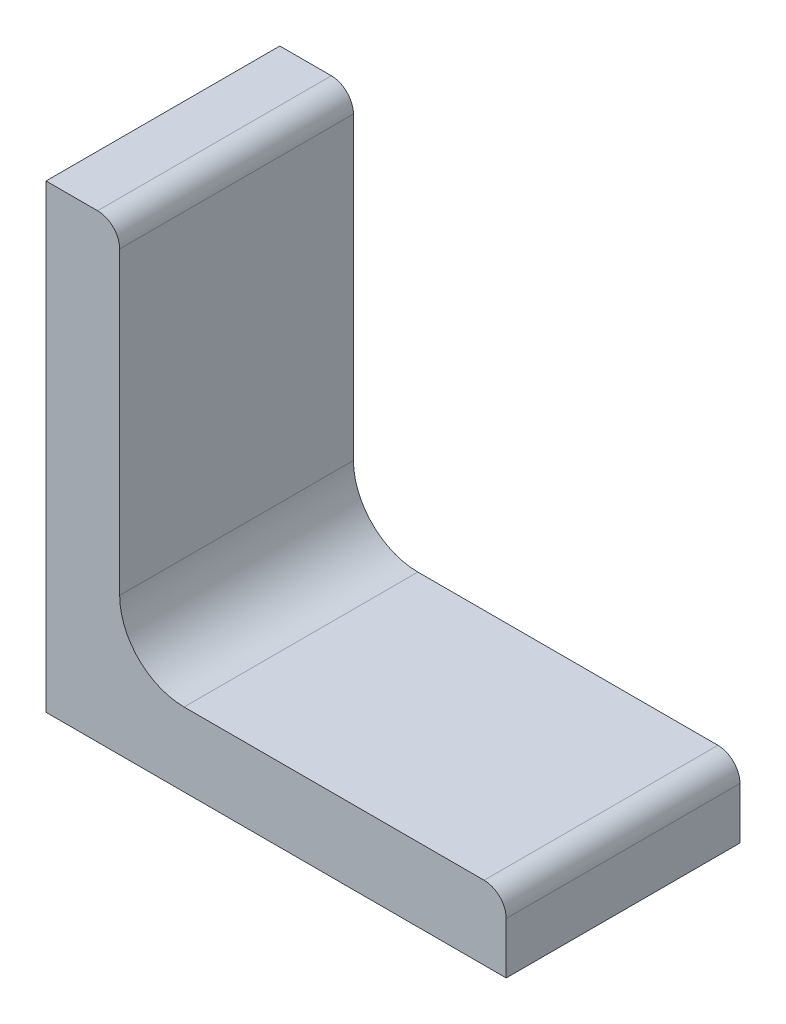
ISO-10303-21;
HEADER;
FILE_DESCRIPTION(('STEP AP214'),'2;1');
FILE_NAME('part.step','',(''),(''),'','','');
FILE_SCHEMA(('AUTOMOTIVE_DESIGN { 1 0 10303 214 1 1 1 1 }'));
ENDSEC;
DATA;
#1=APPLICATION_CONTEXT('core data for automotive mechanical design processes');
#2=APPLICATION_PROTOCOL_DEFINITION('international standard','automotive_design',2000,#1);
#3=PRODUCT_CONTEXT('',#1,'mechanical');
#4=PRODUCT('Part','Part','',(#3));
#5=PRODUCT_RELATED_PRODUCT_CATEGORY('part','',(#4));
#6=PRODUCT_DEFINITION_FORMATION('','',#4);
#7=PRODUCT_DEFINITION_CONTEXT('part definition',#1,'design');
#8=PRODUCT_DEFINITION('design','',#6,#7);
#9=PRODUCT_DEFINITION_SHAPE('','',#8);
#10=(LENGTH_UNIT() NAMED_UNIT(*) SI_UNIT(.MILLI.,.METRE.));
#11=(NAMED_UNIT(*) PLANE_ANGLE_UNIT() SI_UNIT($,.RADIAN.));
#12=(NAMED_UNIT(*) SI_UNIT($,.STERADIAN.) SOLID_ANGLE_UNIT());
#13=UNCERTAINTY_MEASURE_WITH_UNIT(LENGTH_MEASURE(1.E-05),#10,'distance_accuracy_value','');
#14=(GEOMETRIC_REPRESENTATION_CONTEXT(3) GLOBAL_UNCERTAINTY_ASSIGNED_CONTEXT((#13)) GLOBAL_UNIT_ASSIGNED_CONTEXT((#10,
#11,#12)) REPRESENTATION_CONTEXT('',''));
#15=CARTESIAN_POINT('',(0.,0.,0.));
#16=DIRECTION('',(0.,0.,1.));
#17=DIRECTION('',(1.,0.,0.));
#18=AXIS2_PLACEMENT_3D('',#15,#16,#17);
#19=CARTESIAN_POINT('',(0.,0.,12.7));
#20=DIRECTION('',(1.,0.,0.));
#21=DIRECTION('',(0.,0.,-1.));
#22=AXIS2_PLACEMENT_3D('',#19,#20,#21);
#23=PLANE('',#22);
#24=DIRECTION('',(0.,-1.,0.));
#25=VECTOR('',#24,1.);
#26=CARTESIAN_POINT('',(0.,0.,-12.7));
#27=LINE('',#26,#25);
#28=CARTESIAN_POINT('',(0.,50.,-12.7));
#29=VERTEX_POINT('',#28);
#30=CARTESIAN_POINT('',(0.,0.,-12.7));
#31=VERTEX_POINT('',#30);
#32=EDGE_CURVE('E141',#29,#31,#27,.T.);
#33=ORIENTED_EDGE('',*,*,#32,.T.);
#34=DIRECTION('',(0.,0.,-1.));
#35=VECTOR('',#34,1.);
#36=CARTESIAN_POINT('',(0.,0.,12.7));
#37=LINE('',#36,#35);
#38=CARTESIAN_POINT('',(0.,0.,12.7));
#39=VERTEX_POINT('',#38);
#40=EDGE_CURVE('E11',#39,#31,#37,.T.);
#41=ORIENTED_EDGE('',*,*,#40,.F.);
#42=DIRECTION('',(0.,-1.,0.));
#43=VECTOR('',#42,1.);
#44=CARTESIAN_POINT('',(0.,0.,12.7));
#45=LINE('',#44,#43);
#46=CARTESIAN_POINT('',(0.,50.,12.7));
#47=VERTEX_POINT('',#46);
#48=EDGE_CURVE('E157',#47,#39,#45,.T.);
#49=ORIENTED_EDGE('',*,*,#48,.F.);
#50=DIRECTION('',(0.,0.,-1.));
#51=VECTOR('',#50,1.);
#52=CARTESIAN_POINT('',(0.,50.,12.7));
#53=LINE('',#52,#51);
#54=EDGE_CURVE('E137',#47,#29,#53,.T.);
#55=ORIENTED_EDGE('',*,*,#54,.T.);
#56=EDGE_LOOP('',(#33,#41,#49,#55));
#57=FACE_BOUND('',#56,.T.);
#58=ADVANCED_FACE('F39',(#57),#23,.F.);
#59=CARTESIAN_POINT('',(0.,0.,12.7));
#60=DIRECTION('',(0.,1.,0.));
#61=DIRECTION('',(0.,0.,1.));
#62=AXIS2_PLACEMENT_3D('',#59,#60,#61);
#63=PLANE('',#62);
#64=DIRECTION('',(1.,0.,0.));
#65=VECTOR('',#64,1.);
#66=CARTESIAN_POINT('',(0.,0.,-12.7));
#67=LINE('',#66,#65);
#68=CARTESIAN_POINT('',(50.,0.,-12.7));
#69=VERTEX_POINT('',#68);
#70=EDGE_CURVE('E144',#31,#69,#67,.T.);
#71=ORIENTED_EDGE('',*,*,#70,.T.);
#72=DIRECTION('',(0.,0.,-1.));
#73=VECTOR('',#72,1.);
#74=CARTESIAN_POINT('',(50.,0.,12.7));
#75=LINE('',#74,#73);
#76=CARTESIAN_POINT('',(50.,0.,12.7));
#77=VERTEX_POINT('',#76);
#78=EDGE_CURVE('E47',#77,#69,#75,.T.);
#79=ORIENTED_EDGE('',*,*,#78,.F.);
#80=DIRECTION('',(1.,0.,0.));
#81=VECTOR('',#80,1.);
#82=CARTESIAN_POINT('',(0.,0.,12.7));
#83=LINE('',#82,#81);
#84=EDGE_CURVE('E101',#39,#77,#83,.T.);
#85=ORIENTED_EDGE('',*,*,#84,.F.);
#86=ORIENTED_EDGE('',*,*,#40,.T.);
#87=EDGE_LOOP('',(#71,#79,#85,#86));
#88=FACE_BOUND('',#87,.T.);
#89=ADVANCED_FACE('F200',(#88),#63,.F.);
#90=CARTESIAN_POINT('',(50.,0.,12.7));
#91=DIRECTION('',(-1.,0.,0.));
#92=DIRECTION('',(0.,0.,1.));
#93=AXIS2_PLACEMENT_3D('',#90,#91,#92);
#94=PLANE('',#93);
#95=DIRECTION('',(0.,1.,0.));
#96=VECTOR('',#95,1.);
#97=CARTESIAN_POINT('',(50.,0.,-12.7));
#98=LINE('',#97,#96);
#99=CARTESIAN_POINT('',(50.,5.6,-12.7));
#100=VERTEX_POINT('',#99);
#101=EDGE_CURVE('E146',#69,#100,#98,.T.);
#102=ORIENTED_EDGE('',*,*,#101,.T.);
#103=DIRECTION('',(0.,0.,-1.));
#104=VECTOR('',#103,1.);
#105=CARTESIAN_POINT('',(50.,5.6,12.7));
#106=LINE('',#105,#104);
#107=CARTESIAN_POINT('',(50.,5.6,12.7));
#108=VERTEX_POINT('',#107);
#109=EDGE_CURVE('E167',#108,#100,#106,.T.);
#110=ORIENTED_EDGE('',*,*,#109,.F.);
#111=DIRECTION('',(0.,1.,0.));
#112=VECTOR('',#111,1.);
#113=CARTESIAN_POINT('',(50.,0.,12.7));
#114=LINE('',#113,#112);
#115=EDGE_CURVE('E175',#77,#108,#114,.T.);
#116=ORIENTED_EDGE('',*,*,#115,.F.);
#117=ORIENTED_EDGE('',*,*,#78,.T.);
#118=EDGE_LOOP('',(#102,#110,#116,#117));
#119=FACE_BOUND('',#118,.T.);
#120=ADVANCED_FACE('F173',(#119),#94,.F.);
#121=CARTESIAN_POINT('',(47.6,5.6,12.7));
#122=DIRECTION('',(0.,0.,-1.));
#123=DIRECTION('',(-1.,0.,0.));
#124=AXIS2_PLACEMENT_3D('',#121,#122,#123);
#125=CYLINDRICAL_SURFACE('',#124,2.4);
#126=CARTESIAN_POINT('',(47.6,5.6,-12.7));
#127=DIRECTION('',(0.,0.,1.));
#128=DIRECTION('',(1.,0.,0.));
#129=AXIS2_PLACEMENT_3D('',#126,#127,#128);
#130=CIRCLE('',#129,2.4);
#131=CARTESIAN_POINT('',(47.6,8.,-12.7));
#132=VERTEX_POINT('',#131);
#133=EDGE_CURVE('E148',#100,#132,#130,.T.);
#134=ORIENTED_EDGE('',*,*,#133,.T.);
#135=DIRECTION('',(0.,0.,-1.));
#136=VECTOR('',#135,1.);
#137=CARTESIAN_POINT('',(47.6,8.,12.7));
#138=LINE('',#137,#136);
#139=CARTESIAN_POINT('',(47.6,8.,12.7));
#140=VERTEX_POINT('',#139);
#141=EDGE_CURVE('E164',#140,#132,#138,.T.);
#142=ORIENTED_EDGE('',*,*,#141,.F.);
#143=CARTESIAN_POINT('',(47.6,5.6,12.7));
#144=DIRECTION('',(0.,0.,1.));
#145=DIRECTION('',(1.,0.,0.));
#146=AXIS2_PLACEMENT_3D('',#143,#144,#145);
#147=CIRCLE('',#146,2.4);
#148=EDGE_CURVE('E191',#108,#140,#147,.T.);
#149=ORIENTED_EDGE('',*,*,#148,.F.);
#150=ORIENTED_EDGE('',*,*,#109,.T.);
#151=EDGE_LOOP('',(#134,#142,#149,#150));
#152=FACE_BOUND('',#151,.T.);
#153=ADVANCED_FACE('F184',(#152),#125,.T.);
#154=CARTESIAN_POINT('',(15.,8.,12.7));
#155=DIRECTION('',(0.,-1.,0.));
#156=DIRECTION('',(1.,0.,0.));
#157=AXIS2_PLACEMENT_3D('',#154,#155,#156);
#158=PLANE('',#157);
#159=DIRECTION('',(-1.,0.,0.));
#160=VECTOR('',#159,1.);
#161=CARTESIAN_POINT('',(15.,8.,-12.7));
#162=LINE('',#161,#160);
#163=CARTESIAN_POINT('',(15.,8.,-12.7));
#164=VERTEX_POINT('',#163);
#165=EDGE_CURVE('E150',#132,#164,#162,.T.);
#166=ORIENTED_EDGE('',*,*,#165,.T.);
#167=DIRECTION('',(0.,0.,-1.));
#168=VECTOR('',#167,1.);
#169=CARTESIAN_POINT('',(15.,8.,12.7));
#170=LINE('',#169,#168);
#171=CARTESIAN_POINT('',(15.,8.,12.7));
#172=VERTEX_POINT('',#171);
#173=EDGE_CURVE('E161',#172,#164,#170,.T.);
#174=ORIENTED_EDGE('',*,*,#173,.F.);
#175=DIRECTION('',(-1.,0.,0.));
#176=VECTOR('',#175,1.);
#177=CARTESIAN_POINT('',(15.,8.,12.7));
#178=LINE('',#177,#176);
#179=EDGE_CURVE('E190',#140,#172,#178,.T.);
#180=ORIENTED_EDGE('',*,*,#179,.F.);
#181=ORIENTED_EDGE('',*,*,#141,.T.);
#182=EDGE_LOOP('',(#166,#174,#180,#181));
#183=FACE_BOUND('',#182,.T.);
#184=ADVANCED_FACE('F188',(#183),#158,.F.);
#185=CARTESIAN_POINT('',(15.,15.,12.7));
#186=DIRECTION('',(0.,0.,-1.));
#187=DIRECTION('',(-1.,0.,0.));
#188=AXIS2_PLACEMENT_3D('',#185,#186,#187);
#189=CYLINDRICAL_SURFACE('',#188,7.);
#190=CARTESIAN_POINT('',(15.,15.,-12.7));
#191=DIRECTION('',(0.,0.,-1.));
#192=DIRECTION('',(1.,0.,0.));
#193=AXIS2_PLACEMENT_3D('',#190,#191,#192);
#194=CIRCLE('',#193,7.);
#195=CARTESIAN_POINT('',(8.,15.,-12.7));
#196=VERTEX_POINT('',#195);
#197=EDGE_CURVE('E152',#164,#196,#194,.T.);
#198=ORIENTED_EDGE('',*,*,#197,.T.);
#199=DIRECTION('',(0.,0.,-1.));
#200=VECTOR('',#199,1.);
#201=CARTESIAN_POINT('',(8.,15.,12.7));
#202=LINE('',#201,#200);
#203=CARTESIAN_POINT('',(8.,15.,12.7));
#204=VERTEX_POINT('',#203);
#205=EDGE_CURVE('E132',#204,#196,#202,.T.);
#206=ORIENTED_EDGE('',*,*,#205,.F.);
#207=CARTESIAN_POINT('',(15.,15.,12.7));
#208=DIRECTION('',(0.,0.,-1.));
#209=DIRECTION('',(1.,0.,0.));
#210=AXIS2_PLACEMENT_3D('',#207,#208,#209);
#211=CIRCLE('',#210,7.);
#212=EDGE_CURVE('E123',#172,#204,#211,.T.);
#213=ORIENTED_EDGE('',*,*,#212,.F.);
#214=ORIENTED_EDGE('',*,*,#173,.T.);
#215=EDGE_LOOP('',(#198,#206,#213,#214));
#216=FACE_BOUND('',#215,.T.);
#217=ADVANCED_FACE('F212',(#216),#189,.F.);
#218=CARTESIAN_POINT('',(8.,47.6,12.7));
#219=DIRECTION('',(-1.,0.,0.));
#220=DIRECTION('',(0.,-1.,0.));
#221=AXIS2_PLACEMENT_3D('',#218,#219,#220);
#222=PLANE('',#221);
#223=DIRECTION('',(0.,1.,0.));
#224=VECTOR('',#223,1.);
#225=CARTESIAN_POINT('',(8.,47.6,-12.7));
#226=LINE('',#225,#224);
#227=CARTESIAN_POINT('',(8.,47.6,-12.7));
#228=VERTEX_POINT('',#227);
#229=EDGE_CURVE('E131',#196,#228,#226,.T.);
#230=ORIENTED_EDGE('',*,*,#229,.T.);
#231=DIRECTION('',(0.,0.,-1.));
#232=VECTOR('',#231,1.);
#233=CARTESIAN_POINT('',(8.,47.6,12.7));
#234=LINE('',#233,#232);
#235=CARTESIAN_POINT('',(8.,47.6,12.7));
#236=VERTEX_POINT('',#235);
#237=EDGE_CURVE('E128',#236,#228,#234,.T.);
#238=ORIENTED_EDGE('',*,*,#237,.F.);
#239=DIRECTION('',(0.,1.,0.));
#240=VECTOR('',#239,1.);
#241=CARTESIAN_POINT('',(8.,47.6,12.7));
#242=LINE('',#241,#240);
#243=EDGE_CURVE('E117',#204,#236,#242,.T.);
#244=ORIENTED_EDGE('',*,*,#243,.F.);
#245=ORIENTED_EDGE('',*,*,#205,.T.);
#246=EDGE_LOOP('',(#230,#238,#244,#245));
#247=FACE_BOUND('',#246,.T.);
#248=ADVANCED_FACE('F129',(#247),#222,.F.);
#249=CARTESIAN_POINT('',(5.6,47.6,12.7));
#250=DIRECTION('',(0.,0.,-1.));
#251=DIRECTION('',(-1.,0.,0.));
#252=AXIS2_PLACEMENT_3D('',#249,#250,#251);
#253=CYLINDRICAL_SURFACE('',#252,2.4);
#254=CARTESIAN_POINT('',(5.6,47.6,-12.7));
#255=DIRECTION('',(0.,0.,1.));
#256=DIRECTION('',(-1.,0.,0.));
#257=AXIS2_PLACEMENT_3D('',#254,#255,#256);
#258=CIRCLE('',#257,2.4);
#259=CARTESIAN_POINT('',(5.6,50.,-12.7));
#260=VERTEX_POINT('',#259);
#261=EDGE_CURVE('E87',#228,#260,#258,.T.);
#262=ORIENTED_EDGE('',*,*,#261,.T.);
#263=DIRECTION('',(0.,0.,-1.));
#264=VECTOR('',#263,1.);
#265=CARTESIAN_POINT('',(5.6,50.,12.7));
#266=LINE('',#265,#264);
#267=CARTESIAN_POINT('',(5.6,50.,12.7));
#268=VERTEX_POINT('',#267);
#269=EDGE_CURVE('E133',#268,#260,#266,.T.);
#270=ORIENTED_EDGE('',*,*,#269,.F.);
#271=CARTESIAN_POINT('',(5.6,47.6,12.7));
#272=DIRECTION('',(0.,0.,1.));
#273=DIRECTION('',(-1.,0.,0.));
#274=AXIS2_PLACEMENT_3D('',#271,#272,#273);
#275=CIRCLE('',#274,2.4);
#276=EDGE_CURVE('E121',#236,#268,#275,.T.);
#277=ORIENTED_EDGE('',*,*,#276,.F.);
#278=ORIENTED_EDGE('',*,*,#237,.T.);
#279=EDGE_LOOP('',(#262,#270,#277,#278));
#280=FACE_BOUND('',#279,.T.);
#281=ADVANCED_FACE('F135',(#280),#253,.T.);
#282=CARTESIAN_POINT('',(0.,50.,12.7));
#283=DIRECTION('',(0.,-1.,0.));
#284=DIRECTION('',(0.,0.,-1.));
#285=AXIS2_PLACEMENT_3D('',#282,#283,#284);
#286=PLANE('',#285);
#287=DIRECTION('',(-1.,0.,0.));
#288=VECTOR('',#287,1.);
#289=CARTESIAN_POINT('',(0.,50.,-12.7));
#290=LINE('',#289,#288);
#291=EDGE_CURVE('E93',#260,#29,#290,.T.);
#292=ORIENTED_EDGE('',*,*,#291,.T.);
#293=ORIENTED_EDGE('',*,*,#54,.F.);
#294=DIRECTION('',(-1.,0.,0.));
#295=VECTOR('',#294,1.);
#296=CARTESIAN_POINT('',(0.,50.,12.7));
#297=LINE('',#296,#295);
#298=EDGE_CURVE('E55',#268,#47,#297,.T.);
#299=ORIENTED_EDGE('',*,*,#298,.F.);
#300=ORIENTED_EDGE('',*,*,#269,.T.);
#301=EDGE_LOOP('',(#292,#293,#299,#300));
#302=FACE_BOUND('',#301,.T.);
#303=ADVANCED_FACE('F220',(#302),#286,.F.);
#304=CARTESIAN_POINT('',(5.6,47.6,12.7));
#305=DIRECTION('',(0.,0.,-1.));
#306=DIRECTION('',(-1.,0.,0.));
#307=AXIS2_PLACEMENT_3D('',#304,#305,#306);
#308=PLANE('',#307);
#309=ORIENTED_EDGE('',*,*,#48,.T.);
#310=ORIENTED_EDGE('',*,*,#84,.T.);
#311=ORIENTED_EDGE('',*,*,#115,.T.);
#312=ORIENTED_EDGE('',*,*,#148,.T.);
#313=ORIENTED_EDGE('',*,*,#179,.T.);
#314=ORIENTED_EDGE('',*,*,#212,.T.);
#315=ORIENTED_EDGE('',*,*,#243,.T.);
#316=ORIENTED_EDGE('',*,*,#276,.T.);
#317=ORIENTED_EDGE('',*,*,#298,.T.);
#318=EDGE_LOOP('',(#309,#310,#311,#312,#313,#314,#315,#316,#317));
#319=FACE_BOUND('',#318,.T.);
#320=ADVANCED_FACE('F119',(#319),#308,.F.);
#321=CARTESIAN_POINT('',(5.6,47.6,-12.7));
#322=DIRECTION('',(0.,0.,-1.));
#323=DIRECTION('',(-1.,0.,0.));
#324=AXIS2_PLACEMENT_3D('',#321,#322,#323);
#325=PLANE('',#324);
#326=ORIENTED_EDGE('',*,*,#32,.F.);
#327=ORIENTED_EDGE('',*,*,#291,.F.);
#328=ORIENTED_EDGE('',*,*,#261,.F.);
#329=ORIENTED_EDGE('',*,*,#229,.F.);
#330=ORIENTED_EDGE('',*,*,#197,.F.);
#331=ORIENTED_EDGE('',*,*,#165,.F.);
#332=ORIENTED_EDGE('',*,*,#133,.F.);
#333=ORIENTED_EDGE('',*,*,#101,.F.);
#334=ORIENTED_EDGE('',*,*,#70,.F.);
#335=EDGE_LOOP('',(#326,#327,#328,#329,#330,#331,#332,#333,#334));
#336=FACE_BOUND('',#335,.T.);
#337=ADVANCED_FACE('F179',(#336),#325,.T.);
#338=CLOSED_SHELL('',(#58,#89,#120,#153,#184,#217,#248,#281,#303,#320,#337));
#339=MANIFOLD_SOLID_BREP('B2',#338);
#340=ADVANCED_BREP_SHAPE_REPRESENTATION('',(#18,#339),#14);
#341=SHAPE_DEFINITION_REPRESENTATION(#9,#340);
ENDSEC;
END-ISO-10303-21;
